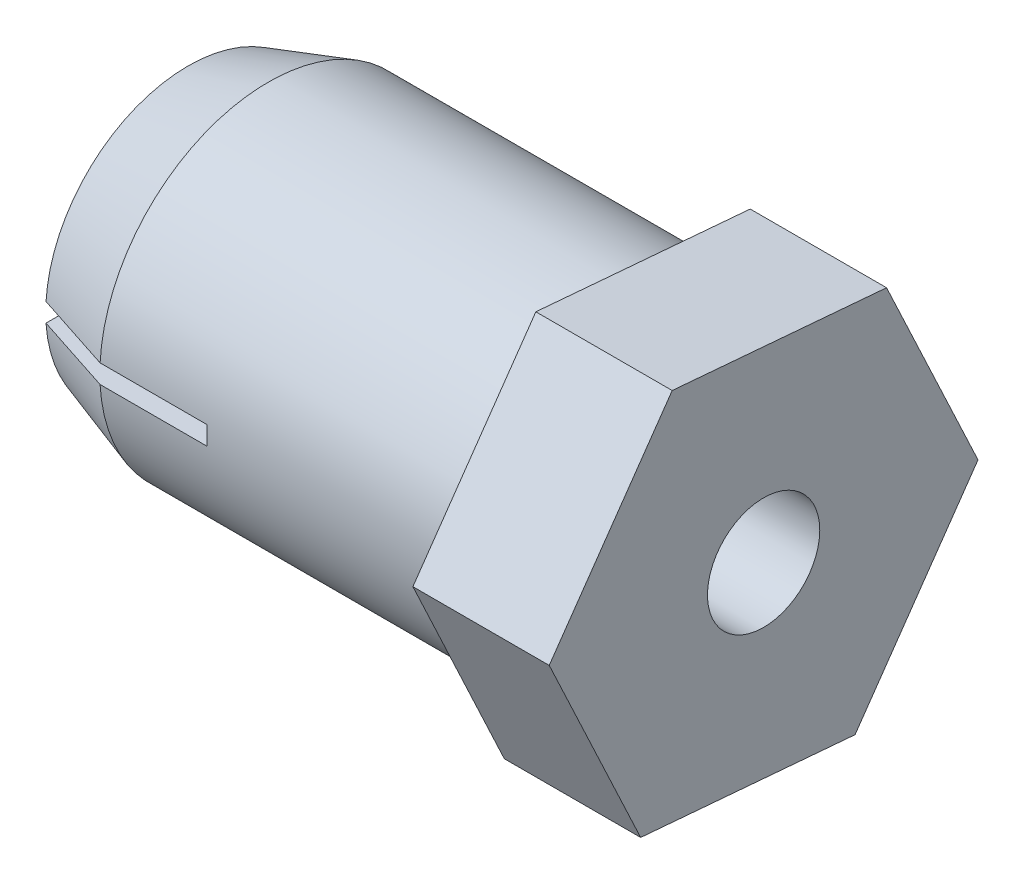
from build123d import *

# Parameters (mm, degrees)
BOSS_EXTRU_1_DEPTH           = 5.1
TROU_TARAUD_M101_D           = 8.5
TROU_TARAUD_M101_DEPTH       = 16.5
TROU_TARAUD_M101_TIP         = 2.553657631
TROU_TARAUD_M51_D            = 4.2
ENL_V_MAT_EXTRU_1_DEPTH      = 20.680771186
ENL_V_MAT_EXTRU_1_DEPTH_BACK = 20.680771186
ESQUISSE7_W                  = 7
ESQUISSE7_H                  = 0.7


with BuildPart() as part:
    # Esquisse1 → R_volution1 (revolve)
    with BuildSketch(Plane.XY, mode=Mode.PRIVATE) as r_volution1_sk:
        Polygon((0, 0), (0, 6.3), (-13.43, 6.3), (-16.43, 5.325), (-16.43, 0), align=None)
    revolve(r_volution1_sk.sketch.rotate(Axis((0, 0, 0), (-1, 0, 0)), 90), axis=Axis((0, 0, 0), (-1, 0, 0)))

    # Esquisse2 → Boss.-Extru.1 (add)
    with BuildSketch(Plane(origin=(0, 0, 0), x_dir=(0, 0, -1), z_dir=(1, 0, 0))):
        Polygon((8.019425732, -0.680693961), (4.599211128, 6.604679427), (-3.420214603, 7.285373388), (-8.019425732, 0.680693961), (-4.599211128, -6.604679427), (3.420214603, -7.285373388), align=None)
    extrude(amount=BOSS_EXTRU_1_DEPTH)

    # Trou taraud_ M101
    with Locations(Plane.ZY.offset(16.43)):
        with Locations((0, 0)):
            Hole(TROU_TARAUD_M101_D / 2, depth=TROU_TARAUD_M101_DEPTH)
            with Locations((0, 0, -(TROU_TARAUD_M101_DEPTH + TROU_TARAUD_M101_TIP / 2))):  # 118° drill point
                Cone(0, TROU_TARAUD_M101_D / 2, TROU_TARAUD_M101_TIP, mode=Mode.SUBTRACT)

    # Trou taraud_ M51 (through all)
    with Locations(Plane(origin=(5.1, 0, 0), x_dir=(0, 0, -1), z_dir=(1, 0, 0))):
        with Locations((0, 0)):
            Hole(TROU_TARAUD_M51_D / 2)

    # Esquisse7 → Enl_v. mat.-Extru.1 (cut, two sides: drawn at the far end of the back side and taken through both)
    with BuildSketch(Plane.XY.offset(-ENL_V_MAT_EXTRU_1_DEPTH_BACK)):
        with Locations((-12.93, 0)):
            Rectangle(ESQUISSE7_W, ESQUISSE7_H)
    extrude(amount=ENL_V_MAT_EXTRU_1_DEPTH + ENL_V_MAT_EXTRU_1_DEPTH_BACK, mode=Mode.SUBTRACT)


solid = part.part
